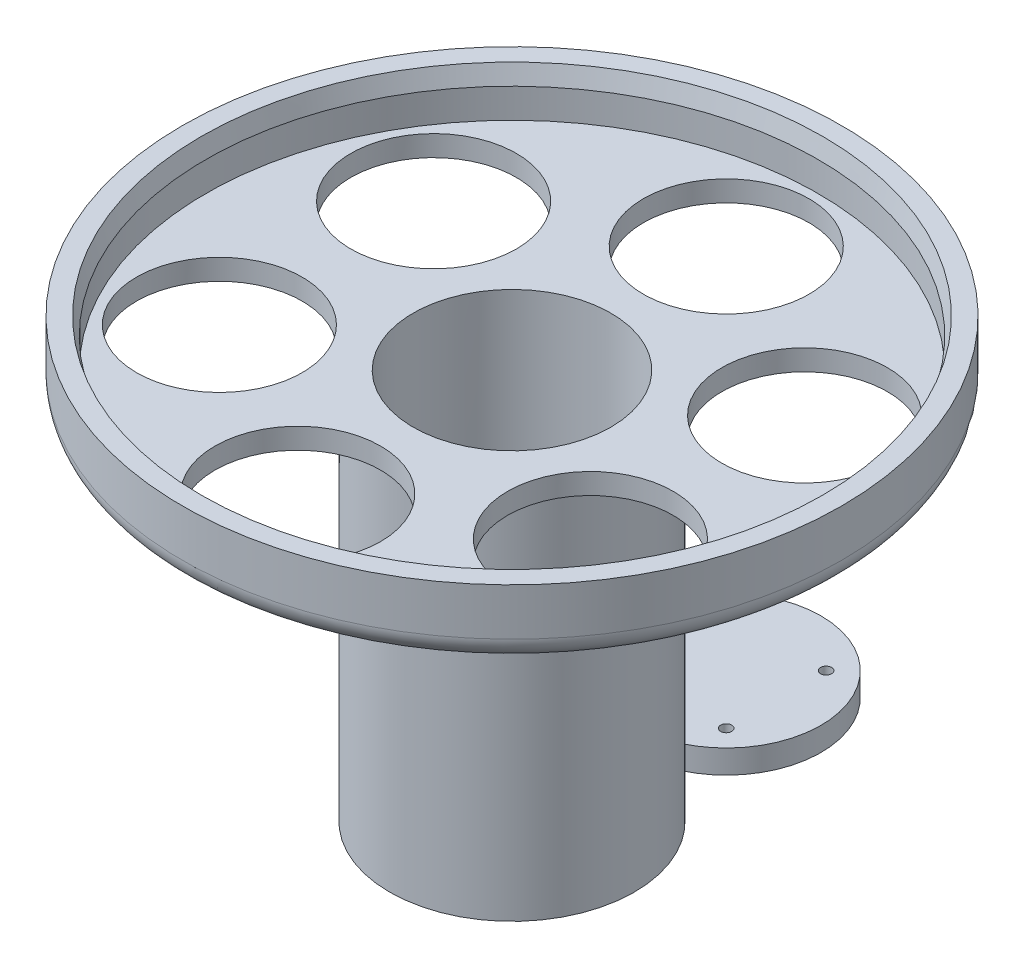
ISO-10303-21;
HEADER;
FILE_DESCRIPTION(('STEP AP214'),'2;1');
FILE_NAME('part.step','',(''),(''),'','','');
FILE_SCHEMA(('AUTOMOTIVE_DESIGN { 1 0 10303 214 1 1 1 1 }'));
ENDSEC;
DATA;
#1=APPLICATION_CONTEXT('core data for automotive mechanical design processes');
#2=APPLICATION_PROTOCOL_DEFINITION('international standard','automotive_design',2000,#1);
#3=PRODUCT_CONTEXT('',#1,'mechanical');
#4=PRODUCT('Part','Part','',(#3));
#5=PRODUCT_RELATED_PRODUCT_CATEGORY('part','',(#4));
#6=PRODUCT_DEFINITION_FORMATION('','',#4);
#7=PRODUCT_DEFINITION_CONTEXT('part definition',#1,'design');
#8=PRODUCT_DEFINITION('design','',#6,#7);
#9=PRODUCT_DEFINITION_SHAPE('','',#8);
#10=(LENGTH_UNIT() NAMED_UNIT(*) SI_UNIT(.MILLI.,.METRE.));
#11=(NAMED_UNIT(*) PLANE_ANGLE_UNIT() SI_UNIT($,.RADIAN.));
#12=(NAMED_UNIT(*) SI_UNIT($,.STERADIAN.) SOLID_ANGLE_UNIT());
#13=UNCERTAINTY_MEASURE_WITH_UNIT(LENGTH_MEASURE(1.E-05),#10,'distance_accuracy_value','');
#14=(GEOMETRIC_REPRESENTATION_CONTEXT(3) GLOBAL_UNCERTAINTY_ASSIGNED_CONTEXT((#13)) GLOBAL_UNIT_ASSIGNED_CONTEXT((#10,
#11,#12)) REPRESENTATION_CONTEXT('',''));
#15=CARTESIAN_POINT('',(0.,0.,0.));
#16=DIRECTION('',(0.,0.,1.));
#17=DIRECTION('',(1.,0.,0.));
#18=AXIS2_PLACEMENT_3D('',#15,#16,#17);
#19=CARTESIAN_POINT('',(-21.,-93.0200000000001,0.));
#20=DIRECTION('',(0.,1.,0.));
#21=DIRECTION('',(-1.,0.,0.));
#22=AXIS2_PLACEMENT_3D('',#19,#20,#21);
#23=PLANE('',#22);
#24=CARTESIAN_POINT('',(10.6066017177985,-93.0199999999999,-56.1066017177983));
#25=DIRECTION('',(0.,-1.,0.));
#26=DIRECTION('',(0.,0.,-1.));
#27=AXIS2_PLACEMENT_3D('',#24,#25,#26);
#28=CIRCLE('',#27,1.175);
#29=CARTESIAN_POINT('',(10.6066017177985,-93.0199999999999,-57.2816017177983));
#30=VERTEX_POINT('',#29);
#31=EDGE_CURVE('E594',#30,#30,#28,.T.);
#32=ORIENTED_EDGE('',*,*,#31,.F.);
#33=EDGE_LOOP('',(#32));
#34=FACE_BOUND('',#33,.T.);
#35=CARTESIAN_POINT('',(-10.6066017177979,-93.02,-34.8933982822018));
#36=DIRECTION('',(0.,-1.,0.));
#37=DIRECTION('',(0.,0.,-1.));
#38=AXIS2_PLACEMENT_3D('',#35,#36,#37);
#39=CIRCLE('',#38,1.175);
#40=CARTESIAN_POINT('',(-10.6066017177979,-93.02,-36.0683982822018));
#41=VERTEX_POINT('',#40);
#42=EDGE_CURVE('E608',#41,#41,#39,.T.);
#43=ORIENTED_EDGE('',*,*,#42,.F.);
#44=EDGE_LOOP('',(#43));
#45=FACE_BOUND('',#44,.T.);
#46=CARTESIAN_POINT('',(3.18893482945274E-13,-93.02,0.));
#47=DIRECTION('',(0.,1.,0.));
#48=DIRECTION('',(-1.,0.,0.));
#49=AXIS2_PLACEMENT_3D('',#46,#47,#48);
#50=CIRCLE('',#49,23.5000000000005);
#51=CARTESIAN_POINT('',(-23.5000000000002,-93.0200000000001,0.));
#52=VERTEX_POINT('',#51);
#53=EDGE_CURVE('E11',#52,#52,#50,.T.);
#54=ORIENTED_EDGE('',*,*,#53,.T.);
#55=EDGE_LOOP('',(#54));
#56=FACE_BOUND('',#55,.T.);
#57=CARTESIAN_POINT('',(3.18893482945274E-13,-93.02,0.));
#58=DIRECTION('',(0.,1.,0.));
#59=DIRECTION('',(-1.,0.,0.));
#60=AXIS2_PLACEMENT_3D('',#57,#58,#59);
#61=CIRCLE('',#60,26.0000000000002);
#62=CARTESIAN_POINT('',(3.79726114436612,-93.02,-25.7212131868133));
#63=VERTEX_POINT('',#62);
#64=CARTESIAN_POINT('',(-3.79726114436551,-93.02,-25.7212131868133));
#65=VERTEX_POINT('',#64);
#66=EDGE_CURVE('E164',#63,#65,#61,.F.);
#67=ORIENTED_EDGE('',*,*,#66,.T.);
#68=CARTESIAN_POINT('',(3.01290859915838E-13,-93.02,-45.5000000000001));
#69=DIRECTION('',(0.,-1.,0.));
#70=DIRECTION('',(1.,0.,0.));
#71=AXIS2_PLACEMENT_3D('',#68,#69,#70);
#72=CIRCLE('',#71,20.14);
#73=EDGE_CURVE('E70',#65,#63,#72,.T.);
#74=ORIENTED_EDGE('',*,*,#73,.T.);
#75=EDGE_LOOP('',(#67,#74));
#76=FACE_BOUND('',#75,.T.);
#77=CARTESIAN_POINT('',(10.6066017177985,-93.0199999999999,-34.8933982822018));
#78=DIRECTION('',(0.,-1.,0.));
#79=DIRECTION('',(0.,0.,-1.));
#80=AXIS2_PLACEMENT_3D('',#77,#78,#79);
#81=CIRCLE('',#80,1.175);
#82=CARTESIAN_POINT('',(10.6066017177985,-93.0199999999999,-36.0683982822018));
#83=VERTEX_POINT('',#82);
#84=EDGE_CURVE('E616',#83,#83,#81,.T.);
#85=ORIENTED_EDGE('',*,*,#84,.F.);
#86=EDGE_LOOP('',(#85));
#87=FACE_BOUND('',#86,.T.);
#88=CARTESIAN_POINT('',(-10.6066017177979,-93.02,-56.1066017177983));
#89=DIRECTION('',(0.,-1.,0.));
#90=DIRECTION('',(0.,0.,-1.));
#91=AXIS2_PLACEMENT_3D('',#88,#89,#90);
#92=CIRCLE('',#91,1.175);
#93=CARTESIAN_POINT('',(-10.6066017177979,-93.02,-57.2816017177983));
#94=VERTEX_POINT('',#93);
#95=EDGE_CURVE('E598',#94,#94,#92,.T.);
#96=ORIENTED_EDGE('',*,*,#95,.F.);
#97=EDGE_LOOP('',(#96));
#98=FACE_BOUND('',#97,.T.);
#99=ADVANCED_FACE('F47',(#34,#45,#56,#76,#87,#98),#23,.F.);
#100=CARTESIAN_POINT('',(0.,0.,0.));
#101=DIRECTION('',(0.,-1.,0.));
#102=DIRECTION('',(1.,0.,0.));
#103=AXIS2_PLACEMENT_3D('',#100,#101,#102);
#104=CYLINDRICAL_SURFACE('',#103,26.0000000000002);
#105=DIRECTION('',(0.,-1.,0.));
#106=VECTOR('',#105,1.);
#107=CARTESIAN_POINT('',(3.79726114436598,-51.5099999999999,-25.7212131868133));
#108=LINE('',#107,#106);
#109=CARTESIAN_POINT('',(3.79726114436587,-15.4999999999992,-25.7212131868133));
#110=VERTEX_POINT('',#109);
#111=CARTESIAN_POINT('',(3.79726114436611,-88.0199999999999,-25.7212131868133));
#112=VERTEX_POINT('',#111);
#113=EDGE_CURVE('E95',#110,#112,#108,.T.);
#114=ORIENTED_EDGE('',*,*,#113,.F.);
#115=CARTESIAN_POINT('',(0.,-15.4999999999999,0.));
#116=DIRECTION('',(0.,1.,0.));
#117=DIRECTION('',(-1.,0.,0.));
#118=AXIS2_PLACEMENT_3D('',#115,#116,#117);
#119=CIRCLE('',#118,26.0000000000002);
#120=CARTESIAN_POINT('',(-3.79726114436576,-15.4999999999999,-25.7212131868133));
#121=VERTEX_POINT('',#120);
#122=EDGE_CURVE('E110',#110,#121,#119,.F.);
#123=ORIENTED_EDGE('',*,*,#122,.T.);
#124=DIRECTION('',(0.,-1.,0.));
#125=VECTOR('',#124,1.);
#126=CARTESIAN_POINT('',(-3.79726114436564,-51.5099999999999,-25.7212131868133));
#127=LINE('',#126,#125);
#128=CARTESIAN_POINT('',(-3.79726114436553,-88.02,-25.7212131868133));
#129=VERTEX_POINT('',#128);
#130=EDGE_CURVE('E92',#129,#121,#127,.F.);
#131=ORIENTED_EDGE('',*,*,#130,.F.);
#132=DIRECTION('',(0.,-1.,0.));
#133=VECTOR('',#132,1.);
#134=CARTESIAN_POINT('',(-3.79726114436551,-90.52,-25.7212131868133));
#135=LINE('',#134,#133);
#136=EDGE_CURVE('E108',#129,#65,#135,.T.);
#137=ORIENTED_EDGE('',*,*,#136,.T.);
#138=ORIENTED_EDGE('',*,*,#66,.F.);
#139=DIRECTION('',(0.,-1.,0.));
#140=VECTOR('',#139,1.);
#141=CARTESIAN_POINT('',(3.79726114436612,-90.52,-25.7212131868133));
#142=LINE('',#141,#140);
#143=EDGE_CURVE('E120',#63,#112,#142,.F.);
#144=ORIENTED_EDGE('',*,*,#143,.T.);
#145=EDGE_LOOP('',(#114,#123,#131,#137,#138,#144));
#146=FACE_BOUND('',#145,.T.);
#147=ADVANCED_FACE('F106',(#146),#104,.T.);
#148=CARTESIAN_POINT('',(0.,-15.4999999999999,0.));
#149=DIRECTION('',(0.,1.,0.));
#150=DIRECTION('',(-1.,0.,0.));
#151=AXIS2_PLACEMENT_3D('',#148,#149,#150);
#152=TOROIDAL_SURFACE('',#151,26.5000000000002,0.5);
#153=CARTESIAN_POINT('',(6.09253702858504,-15.5001999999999,-26.3036307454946));
#154=CARTESIAN_POINT('',(6.09258310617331,-15.4848406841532,-26.3036458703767));
#155=CARTESIAN_POINT('',(6.09123858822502,-15.4695252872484,-26.3032186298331));
#156=CARTESIAN_POINT('',(6.08608211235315,-15.439512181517,-26.3015829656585));
#157=CARTESIAN_POINT('',(6.08229527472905,-15.424809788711,-26.3003824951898));
#158=CARTESIAN_POINT('',(6.07149385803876,-15.3931058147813,-26.2969638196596));
#159=CARTESIAN_POINT('',(6.06395504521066,-15.376303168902,-26.294580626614));
#160=CARTESIAN_POINT('',(6.04636214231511,-15.3441666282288,-26.2890346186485));
#161=CARTESIAN_POINT('',(6.03629787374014,-15.3288390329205,-26.2858686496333));
#162=CARTESIAN_POINT('',(6.00873065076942,-15.2923747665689,-26.2772256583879));
#163=CARTESIAN_POINT('',(5.99004180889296,-15.2722276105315,-26.2713902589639));
#164=CARTESIAN_POINT('',(5.94998303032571,-15.2351244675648,-26.2589566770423));
#165=CARTESIAN_POINT('',(5.92860746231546,-15.2181753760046,-26.2523568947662));
#166=CARTESIAN_POINT('',(5.86627459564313,-15.1744566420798,-26.2332368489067));
#167=CARTESIAN_POINT('',(5.82336547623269,-15.1507172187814,-26.2202145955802));
#168=CARTESIAN_POINT('',(5.73476396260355,-15.1097681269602,-26.1936733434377));
#169=CARTESIAN_POINT('',(5.68906593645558,-15.0925722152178,-26.1801533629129));
#170=CARTESIAN_POINT('',(5.59652268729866,-15.06341875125,-26.15314404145));
#171=CARTESIAN_POINT('',(5.5496909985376,-15.0514166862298,-26.1396554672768));
#172=CARTESIAN_POINT('',(5.45510987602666,-15.0315134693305,-26.1127928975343));
#173=CARTESIAN_POINT('',(5.40735959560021,-15.0236163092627,-26.0994190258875));
#174=CARTESIAN_POINT('',(5.31114516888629,-15.0112959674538,-26.0728582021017));
#175=CARTESIAN_POINT('',(5.26267882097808,-15.006888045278,-26.0596723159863));
#176=CARTESIAN_POINT('',(5.16547384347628,-15.0011841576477,-26.0336183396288));
#177=CARTESIAN_POINT('',(5.11673513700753,-14.9998891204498,-26.0207503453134));
#178=CARTESIAN_POINT('',(4.99257966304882,-15.0001907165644,-25.9884699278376));
#179=CARTESIAN_POINT('',(4.91709645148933,-15.0037473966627,-25.9693119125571));
#180=CARTESIAN_POINT('',(4.76647252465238,-15.0170833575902,-25.9320066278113));
#181=CARTESIAN_POINT('',(4.69133172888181,-15.0268610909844,-25.9138591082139));
#182=CARTESIAN_POINT('',(4.54229367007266,-15.0526330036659,-25.878761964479));
#183=CARTESIAN_POINT('',(4.46839164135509,-15.0685893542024,-25.8618057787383));
#184=CARTESIAN_POINT('',(4.35883905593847,-15.0978628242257,-25.8373062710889));
#185=CARTESIAN_POINT('',(4.32256668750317,-15.1084998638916,-25.8293015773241));
#186=CARTESIAN_POINT('',(4.25061392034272,-15.1318182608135,-25.8136282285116));
#187=CARTESIAN_POINT('',(4.2149333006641,-15.1444988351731,-25.8059594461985));
#188=CARTESIAN_POINT('',(4.15339007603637,-15.1687975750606,-25.7929029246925));
#189=CARTESIAN_POINT('',(4.12733094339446,-15.1798705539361,-25.7874296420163));
#190=CARTESIAN_POINT('',(4.07585659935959,-15.2037059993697,-25.776722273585));
#191=CARTESIAN_POINT('',(4.05044301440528,-15.2164723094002,-25.7714887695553));
#192=CARTESIAN_POINT('',(3.9978381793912,-15.2456917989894,-25.7607575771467));
#193=CARTESIAN_POINT('',(3.97077960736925,-15.2624003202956,-25.7552989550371));
#194=CARTESIAN_POINT('',(3.91907817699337,-15.2993827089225,-25.7449726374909));
#195=CARTESIAN_POINT('',(3.89442504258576,-15.3196402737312,-25.7401024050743));
#196=CARTESIAN_POINT('',(3.86325778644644,-15.351829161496,-25.7339956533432));
#197=CARTESIAN_POINT('',(3.85463273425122,-15.3616080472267,-25.7323123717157));
#198=CARTESIAN_POINT('',(3.83860698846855,-15.382179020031,-25.7291942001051));
#199=CARTESIAN_POINT('',(3.83120588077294,-15.3929707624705,-25.7277592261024));
#200=CARTESIAN_POINT('',(3.8191548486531,-15.4138824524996,-25.7254282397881));
#201=CARTESIAN_POINT('',(3.81425711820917,-15.4238518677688,-25.7244833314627));
#202=CARTESIAN_POINT('',(3.80614050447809,-15.4444650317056,-25.7229195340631));
#203=CARTESIAN_POINT('',(3.80291598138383,-15.4551063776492,-25.7222995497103));
#204=CARTESIAN_POINT('',(3.79957187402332,-15.4715777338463,-25.7216569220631));
#205=CARTESIAN_POINT('',(3.79870484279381,-15.4772556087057,-25.7214903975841));
#206=CARTESIAN_POINT('',(3.79754387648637,-15.4886874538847,-25.7212674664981));
#207=CARTESIAN_POINT('',(3.79725154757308,-15.4944415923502,-25.721211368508));
#208=CARTESIAN_POINT('',(3.79726126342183,-15.5001999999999,-25.7212132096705));
#209=B_SPLINE_CURVE_WITH_KNOTS('',3,(#153,#154,#155,#156,#157,#158,#159,#160,#161,#162,#163,
#164,#165,#166,#167,#168,#169,#170,#171,#172,#173,#174,#175,#176,#177,#178,#179,#180,#181,#182,
#183,#184,#185,#186,#187,#188,#189,#190,#191,#192,#193,#194,#195,#196,#197,#198,#199,#200,#201,
#202,#203,#204,#205,#206,#207,#208),.UNSPECIFIED.,.F.,.F.,(4,2,2,2,2,2,2,2,2,2,2,2,2,2,2,2,2,2,
2,2,2,2,2,2,2,2,2,4),(0.,0.0459392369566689,0.0914133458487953,0.146816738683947,
0.202447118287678,0.28625220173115,0.370235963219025,0.52159683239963,0.67327418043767,
0.823624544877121,0.974120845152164,1.12527173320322,1.27646768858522,1.5100453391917,
1.74356491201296,1.97567680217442,2.09154803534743,2.20737498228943,2.29384789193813,
2.38052054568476,2.47718214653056,2.57341084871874,2.61278278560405,2.65214137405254,
2.68546774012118,2.71868103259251,2.73589186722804,2.75315073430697),.UNSPECIFIED.);
#210=CARTESIAN_POINT('',(5.07413250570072,-14.9999999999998,-26.0096747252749));
#211=VERTEX_POINT('',#210);
#212=EDGE_CURVE('E112',#211,#110,#209,.T.);
#213=ORIENTED_EDGE('',*,*,#212,.F.);
#214=CARTESIAN_POINT('',(0.,-14.9999999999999,0.));
#215=DIRECTION('',(0.,1.,0.));
#216=DIRECTION('',(-1.,0.,0.));
#217=AXIS2_PLACEMENT_3D('',#214,#215,#216);
#218=CIRCLE('',#217,26.5000000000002);
#219=CARTESIAN_POINT('',(-5.07413250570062,-14.9999999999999,-26.0096747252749));
#220=VERTEX_POINT('',#219);
#221=EDGE_CURVE('E237',#220,#211,#218,.T.);
#222=ORIENTED_EDGE('',*,*,#221,.F.);
#223=CARTESIAN_POINT('',(-3.79726126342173,-15.5001999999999,-25.7212132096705));
#224=CARTESIAN_POINT('',(-3.79721352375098,-15.4894041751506,-25.7212042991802));
#225=CARTESIAN_POINT('',(-3.7982746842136,-15.4786580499,-25.7214077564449));
#226=CARTESIAN_POINT('',(-3.80228062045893,-15.4576905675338,-25.7221773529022));
#227=CARTESIAN_POINT('',(-3.80519781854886,-15.4474638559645,-25.7227381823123));
#228=CARTESIAN_POINT('',(-3.81357185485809,-15.4250220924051,-25.7243510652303));
#229=CARTESIAN_POINT('',(-3.81949498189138,-15.412991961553,-25.7254935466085));
#230=CARTESIAN_POINT('',(-3.83314623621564,-15.3899887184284,-25.7281351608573));
#231=CARTESIAN_POINT('',(-3.84088540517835,-15.3790226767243,-25.7296364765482));
#232=CARTESIAN_POINT('',(-3.86395175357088,-15.3501767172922,-25.7341279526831));
#233=CARTESIAN_POINT('',(-3.88057116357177,-15.3333867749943,-25.7373816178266));
#234=CARTESIAN_POINT('',(-3.91585468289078,-15.3022954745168,-25.7443423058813));
#235=CARTESIAN_POINT('',(-3.93452299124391,-15.2879993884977,-25.7480502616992));
#236=CARTESIAN_POINT('',(-3.98171414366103,-15.2553122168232,-25.7574986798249));
#237=CARTESIAN_POINT('',(-4.01090915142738,-15.2379506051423,-25.7634062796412));
#238=CARTESIAN_POINT('',(-4.07072257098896,-15.2060187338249,-25.7756557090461));
#239=CARTESIAN_POINT('',(-4.10134382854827,-15.1914543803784,-25.781998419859));
#240=CARTESIAN_POINT('',(-4.16362966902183,-15.1644341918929,-25.7950563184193));
#241=CARTESIAN_POINT('',(-4.19529914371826,-15.1519906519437,-25.8017733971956));
#242=CARTESIAN_POINT('',(-4.25919418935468,-15.1289320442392,-25.8154899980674));
#243=CARTESIAN_POINT('',(-4.29141926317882,-15.1183154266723,-25.8224892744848));
#244=CARTESIAN_POINT('',(-4.39268637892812,-15.0875855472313,-25.8447497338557));
#245=CARTESIAN_POINT('',(-4.46245849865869,-15.0701865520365,-25.8604672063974));
#246=CARTESIAN_POINT('',(-4.60301454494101,-15.0411779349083,-25.8929329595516));
#247=CARTESIAN_POINT('',(-4.67379965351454,-15.0295757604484,-25.9096825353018));
#248=CARTESIAN_POINT('',(-4.81551945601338,-15.0119411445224,-25.9440376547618));
#249=CARTESIAN_POINT('',(-4.88645208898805,-15.0058841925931,-25.9616390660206));
#250=CARTESIAN_POINT('',(-5.02830313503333,-14.9994551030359,-25.997663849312));
#251=CARTESIAN_POINT('',(-5.09922148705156,-14.9990770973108,-26.0160863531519));
#252=CARTESIAN_POINT('',(-5.22225136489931,-15.0039389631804,-26.0487629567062));
#253=CARTESIAN_POINT('',(-5.27446087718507,-15.0077444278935,-26.0628561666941));
#254=CARTESIAN_POINT('',(-5.37845897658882,-15.0193224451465,-26.0913757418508));
#255=CARTESIAN_POINT('',(-5.43024654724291,-15.0271027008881,-26.1058027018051));
#256=CARTESIAN_POINT('',(-5.5443683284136,-15.0495989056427,-26.1380834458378));
#257=CARTESIAN_POINT('',(-5.60648247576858,-15.0654736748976,-26.1559847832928));
#258=CARTESIAN_POINT('',(-5.69729408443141,-15.0961069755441,-26.1826130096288));
#259=CARTESIAN_POINT('',(-5.72712579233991,-15.1074315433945,-26.19143793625));
#260=CARTESIAN_POINT('',(-5.78566794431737,-15.1327717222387,-26.2088991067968));
#261=CARTESIAN_POINT('',(-5.81437966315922,-15.1467841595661,-26.2175355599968));
#262=CARTESIAN_POINT('',(-5.86297854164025,-15.1740407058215,-26.2322665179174));
#263=CARTESIAN_POINT('',(-5.88324266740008,-15.186562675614,-26.2384456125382));
#264=CARTESIAN_POINT('',(-5.92248048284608,-15.2137075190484,-26.2504741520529));
#265=CARTESIAN_POINT('',(-5.9414526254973,-15.2283328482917,-26.2563232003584));
#266=CARTESIAN_POINT('',(-5.97766734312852,-15.2601577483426,-26.2675416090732));
#267=CARTESIAN_POINT('',(-5.99489002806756,-15.2773823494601,-26.2729053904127));
#268=CARTESIAN_POINT('',(-6.0263804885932,-15.3145860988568,-26.2827523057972));
#269=CARTESIAN_POINT('',(-6.04065619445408,-15.3345576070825,-26.2872378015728));
#270=CARTESIAN_POINT('',(-6.06051410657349,-15.369618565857,-26.2934949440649));
#271=CARTESIAN_POINT('',(-6.06738067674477,-15.3839068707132,-26.2956638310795));
#272=CARTESIAN_POINT('',(-6.07883728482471,-15.4134393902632,-26.2992871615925));
#273=CARTESIAN_POINT('',(-6.0834334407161,-15.4286809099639,-26.3007435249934));
#274=CARTESIAN_POINT('',(-6.08862686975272,-15.4533957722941,-26.3023900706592));
#275=CARTESIAN_POINT('',(-6.09009098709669,-15.4626744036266,-26.3028545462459));
#276=CARTESIAN_POINT('',(-6.09205312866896,-15.4813661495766,-26.3034771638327));
#277=CARTESIAN_POINT('',(-6.09254874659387,-15.4907795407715,-26.3036345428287));
#278=CARTESIAN_POINT('',(-6.09253702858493,-15.5001999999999,-26.3036307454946));
#279=B_SPLINE_CURVE_WITH_KNOTS('',3,(#223,#224,#225,#226,#227,#228,#229,#230,#231,#232,#233,
#234,#235,#236,#237,#238,#239,#240,#241,#242,#243,#244,#245,#246,#247,#248,#249,#250,#251,#252,
#253,#254,#255,#256,#257,#258,#259,#260,#261,#262,#263,#264,#265,#266,#267,#268,#269,#270,#271,
#272,#273,#274,#275,#276,#277,#278),.UNSPECIFIED.,.F.,.F.,(4,2,2,2,2,2,2,2,2,2,2,2,2,2,2,2,2,2,
2,2,2,2,2,2,2,2,2,4),(0.,0.0322504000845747,0.0640324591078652,0.104177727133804,
0.144573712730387,0.215714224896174,0.287003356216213,0.39018704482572,0.493586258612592,
0.597565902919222,0.70145689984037,0.921945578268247,1.14271680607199,1.36250742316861,
1.5820709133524,1.74457576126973,1.90739674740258,2.10648291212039,2.20571100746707,
2.30482265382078,2.3785537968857,2.45237172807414,2.52695216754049,2.60132921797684,
2.64916404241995,2.69686925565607,2.7250326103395,2.7532658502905),.UNSPECIFIED.);
#280=EDGE_CURVE('E113',#121,#220,#279,.T.);
#281=ORIENTED_EDGE('',*,*,#280,.F.);
#282=ORIENTED_EDGE('',*,*,#122,.F.);
#283=EDGE_LOOP('',(#213,#222,#281,#282));
#284=FACE_BOUND('',#283,.T.);
#285=ADVANCED_FACE('F263',(#284),#152,.F.);
#286=CARTESIAN_POINT('',(0.,1.07498440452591E-13,0.));
#287=DIRECTION('',(0.,-1.,0.));
#288=DIRECTION('',(1.,0.,0.));
#289=AXIS2_PLACEMENT_3D('',#286,#287,#288);
#290=PLANE('',#289);
#291=CARTESIAN_POINT('',(0.,1.07498440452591E-13,0.));
#292=DIRECTION('',(0.,-1.,0.));
#293=DIRECTION('',(1.,0.,0.));
#294=AXIS2_PLACEMENT_3D('',#291,#292,#293);
#295=CIRCLE('',#294,66.0000000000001);
#296=CARTESIAN_POINT('',(66.0000000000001,3.33761285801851E-13,0.));
#297=VERTEX_POINT('',#296);
#298=EDGE_CURVE('E169',#297,#297,#295,.T.);
#299=ORIENTED_EDGE('',*,*,#298,.T.);
#300=EDGE_LOOP('',(#299));
#301=FACE_BOUND('',#300,.T.);
#302=CARTESIAN_POINT('',(0.,1.07498440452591E-13,0.));
#303=DIRECTION('',(0.,-1.,0.));
#304=DIRECTION('',(1.,0.,0.));
#305=AXIS2_PLACEMENT_3D('',#302,#303,#304);
#306=CIRCLE('',#305,70.);
#307=CARTESIAN_POINT('',(70.,3.47474185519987E-13,0.));
#308=VERTEX_POINT('',#307);
#309=EDGE_CURVE('E165',#308,#308,#306,.T.);
#310=ORIENTED_EDGE('',*,*,#309,.F.);
#311=EDGE_LOOP('',(#310));
#312=FACE_BOUND('',#311,.T.);
#313=ADVANCED_FACE('F271',(#301,#312),#290,.F.);
#314=CARTESIAN_POINT('',(0.,0.,0.));
#315=DIRECTION('',(0.,-1.,0.));
#316=DIRECTION('',(1.,0.,0.));
#317=AXIS2_PLACEMENT_3D('',#314,#315,#316);
#318=CYLINDRICAL_SURFACE('',#317,70.);
#319=CARTESIAN_POINT('',(0.,-9.99999999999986,0.));
#320=DIRECTION('',(0.,1.,0.));
#321=DIRECTION('',(-1.,0.,0.));
#322=AXIS2_PLACEMENT_3D('',#319,#320,#321);
#323=CIRCLE('',#322,70.);
#324=CARTESIAN_POINT('',(-70.,-10.0000000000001,0.));
#325=VERTEX_POINT('',#324);
#326=EDGE_CURVE('E231',#325,#325,#323,.T.);
#327=ORIENTED_EDGE('',*,*,#326,.T.);
#328=EDGE_LOOP('',(#327));
#329=FACE_BOUND('',#328,.T.);
#330=ORIENTED_EDGE('',*,*,#309,.T.);
#331=EDGE_LOOP('',(#330));
#332=FACE_BOUND('',#331,.T.);
#333=ADVANCED_FACE('F274',(#329,#332),#318,.T.);
#334=CARTESIAN_POINT('',(-65.,-15.0000000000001,0.));
#335=DIRECTION('',(0.,1.,0.));
#336=DIRECTION('',(-1.,0.,0.));
#337=AXIS2_PLACEMENT_3D('',#334,#335,#336);
#338=PLANE('',#337);
#339=ORIENTED_EDGE('',*,*,#221,.T.);
#340=CARTESIAN_POINT('',(0.,-14.9999999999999,-45.5000000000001));
#341=DIRECTION('',(0.,1.,0.));
#342=DIRECTION('',(-1.,0.,0.));
#343=AXIS2_PLACEMENT_3D('',#340,#341,#342);
#344=CIRCLE('',#343,20.14);
#345=EDGE_CURVE('E63',#220,#211,#344,.T.);
#346=ORIENTED_EDGE('',*,*,#345,.F.);
#347=EDGE_LOOP('',(#339,#346));
#348=FACE_BOUND('',#347,.T.);
#349=CARTESIAN_POINT('',(0.,-14.9999999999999,0.));
#350=DIRECTION('',(0.,1.,0.));
#351=DIRECTION('',(-1.,0.,0.));
#352=AXIS2_PLACEMENT_3D('',#349,#350,#351);
#353=CIRCLE('',#352,65.);
#354=CARTESIAN_POINT('',(-65.,-15.0000000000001,0.));
#355=VERTEX_POINT('',#354);
#356=EDGE_CURVE('E227',#355,#355,#353,.F.);
#357=ORIENTED_EDGE('',*,*,#356,.T.);
#358=EDGE_LOOP('',(#357));
#359=FACE_BOUND('',#358,.T.);
#360=CARTESIAN_POINT('',(0.,-14.9999999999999,45.5000000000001));
#361=DIRECTION('',(0.,1.,0.));
#362=DIRECTION('',(-1.,0.,0.));
#363=AXIS2_PLACEMENT_3D('',#360,#361,#362);
#364=CIRCLE('',#363,18.59);
#365=CARTESIAN_POINT('',(-18.59,-14.9999999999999,45.5000000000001));
#366=VERTEX_POINT('',#365);
#367=EDGE_CURVE('E203',#366,#366,#364,.T.);
#368=ORIENTED_EDGE('',*,*,#367,.T.);
#369=EDGE_LOOP('',(#368));
#370=FACE_BOUND('',#369,.T.);
#371=CARTESIAN_POINT('',(39.404155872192,-14.9999999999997,22.7500000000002));
#372=DIRECTION('',(0.,1.,0.));
#373=DIRECTION('',(-1.,0.,0.));
#374=AXIS2_PLACEMENT_3D('',#371,#372,#373);
#375=CIRCLE('',#374,18.5900000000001);
#376=CARTESIAN_POINT('',(20.8141558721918,-14.9999999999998,22.7500000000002));
#377=VERTEX_POINT('',#376);
#378=EDGE_CURVE('E199',#377,#377,#375,.T.);
#379=ORIENTED_EDGE('',*,*,#378,.T.);
#380=EDGE_LOOP('',(#379));
#381=FACE_BOUND('',#380,.T.);
#382=CARTESIAN_POINT('',(39.4041558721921,-14.9999999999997,-22.7499999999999));
#383=DIRECTION('',(0.,1.,0.));
#384=DIRECTION('',(-1.,0.,0.));
#385=AXIS2_PLACEMENT_3D('',#382,#383,#384);
#386=CIRCLE('',#385,18.5900000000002);
#387=CARTESIAN_POINT('',(20.8141558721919,-14.9999999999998,-22.7499999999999));
#388=VERTEX_POINT('',#387);
#389=EDGE_CURVE('E195',#388,#388,#386,.T.);
#390=ORIENTED_EDGE('',*,*,#389,.T.);
#391=EDGE_LOOP('',(#390));
#392=FACE_BOUND('',#391,.T.);
#393=CARTESIAN_POINT('',(-39.4041558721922,-15.,22.7499999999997));
#394=DIRECTION('',(0.,1.,0.));
#395=DIRECTION('',(-1.,0.,0.));
#396=AXIS2_PLACEMENT_3D('',#393,#394,#395);
#397=CIRCLE('',#396,18.5900000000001);
#398=CARTESIAN_POINT('',(-57.9941558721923,-15.0000000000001,22.7499999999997));
#399=VERTEX_POINT('',#398);
#400=EDGE_CURVE('E191',#399,#399,#397,.T.);
#401=ORIENTED_EDGE('',*,*,#400,.T.);
#402=EDGE_LOOP('',(#401));
#403=FACE_BOUND('',#402,.T.);
#404=CARTESIAN_POINT('',(-39.4041558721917,-15.,-22.7500000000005));
#405=DIRECTION('',(0.,1.,0.));
#406=DIRECTION('',(-1.,0.,0.));
#407=AXIS2_PLACEMENT_3D('',#404,#405,#406);
#408=CIRCLE('',#407,18.5900000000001);
#409=CARTESIAN_POINT('',(-57.9941558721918,-15.0000000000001,-22.7500000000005));
#410=VERTEX_POINT('',#409);
#411=EDGE_CURVE('E187',#410,#410,#408,.T.);
#412=ORIENTED_EDGE('',*,*,#411,.T.);
#413=EDGE_LOOP('',(#412));
#414=FACE_BOUND('',#413,.T.);
#415=CARTESIAN_POINT('',(0.,-14.9999999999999,-45.5000000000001));
#416=DIRECTION('',(0.,1.,0.));
#417=DIRECTION('',(-1.,0.,0.));
#418=AXIS2_PLACEMENT_3D('',#415,#416,#417);
#419=CIRCLE('',#418,18.59);
#420=CARTESIAN_POINT('',(-18.59,-14.9999999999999,-45.5000000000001));
#421=VERTEX_POINT('',#420);
#422=EDGE_CURVE('E183',#421,#421,#419,.T.);
#423=ORIENTED_EDGE('',*,*,#422,.T.);
#424=EDGE_LOOP('',(#423));
#425=FACE_BOUND('',#424,.T.);
#426=ADVANCED_FACE('F278',(#348,#359,#370,#381,#392,#403,#414,#425),#338,.F.);
#427=CARTESIAN_POINT('',(0.,0.,0.));
#428=DIRECTION('',(0.,-1.,0.));
#429=DIRECTION('',(1.,0.,0.));
#430=AXIS2_PLACEMENT_3D('',#427,#428,#429);
#431=CYLINDRICAL_SURFACE('',#430,65.);
#432=CARTESIAN_POINT('',(0.,-3.73205080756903,0.));
#433=DIRECTION('',(0.,-1.,0.));
#434=DIRECTION('',(1.,0.,0.));
#435=AXIS2_PLACEMENT_3D('',#432,#433,#434);
#436=CIRCLE('',#435,65.);
#437=CARTESIAN_POINT('',(65.,-3.73205080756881,0.));
#438=VERTEX_POINT('',#437);
#439=EDGE_CURVE('E175',#438,#438,#436,.F.);
#440=ORIENTED_EDGE('',*,*,#439,.T.);
#441=EDGE_LOOP('',(#440));
#442=FACE_BOUND('',#441,.T.);
#443=CARTESIAN_POINT('',(0.,-9.99999999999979,0.));
#444=DIRECTION('',(0.,-1.,0.));
#445=DIRECTION('',(1.,0.,0.));
#446=AXIS2_PLACEMENT_3D('',#443,#444,#445);
#447=CIRCLE('',#446,65.);
#448=CARTESIAN_POINT('',(65.0000000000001,-9.99999999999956,0.));
#449=VERTEX_POINT('',#448);
#450=EDGE_CURVE('E160',#449,#449,#447,.T.);
#451=ORIENTED_EDGE('',*,*,#450,.T.);
#452=EDGE_LOOP('',(#451));
#453=FACE_BOUND('',#452,.T.);
#454=ADVANCED_FACE('F269',(#442,#453),#431,.F.);
#455=CARTESIAN_POINT('',(-65.,-10.0000000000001,0.));
#456=DIRECTION('',(0.,1.,0.));
#457=DIRECTION('',(-1.,0.,0.));
#458=AXIS2_PLACEMENT_3D('',#455,#456,#457);
#459=PLANE('',#458);
#460=CARTESIAN_POINT('',(-39.4041558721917,-9.99999999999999,-22.7500000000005));
#461=DIRECTION('',(0.,1.,0.));
#462=DIRECTION('',(-0.50000000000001,0.,0.866025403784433));
#463=AXIS2_PLACEMENT_3D('',#460,#461,#462);
#464=CIRCLE('',#463,17.59);
#465=CARTESIAN_POINT('',(-48.1991558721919,-10.,-7.51661314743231));
#466=VERTEX_POINT('',#465);
#467=EDGE_CURVE('E132',#466,#466,#464,.T.);
#468=ORIENTED_EDGE('',*,*,#467,.F.);
#469=EDGE_LOOP('',(#468));
#470=FACE_BOUND('',#469,.T.);
#471=CARTESIAN_POINT('',(-39.4041558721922,-9.99999999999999,22.7499999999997));
#472=DIRECTION('',(0.,1.,0.));
#473=DIRECTION('',(0.499999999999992,0.,0.866025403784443));
#474=AXIS2_PLACEMENT_3D('',#471,#472,#473);
#475=CIRCLE('',#474,17.59);
#476=CARTESIAN_POINT('',(-30.6091558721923,-9.99999999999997,37.983386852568));
#477=VERTEX_POINT('',#476);
#478=EDGE_CURVE('E142',#477,#477,#475,.T.);
#479=ORIENTED_EDGE('',*,*,#478,.F.);
#480=EDGE_LOOP('',(#479));
#481=FACE_BOUND('',#480,.T.);
#482=CARTESIAN_POINT('',(0.,-9.99999999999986,45.5000000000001));
#483=DIRECTION('',(0.,1.,0.));
#484=DIRECTION('',(1.,0.,0.));
#485=AXIS2_PLACEMENT_3D('',#482,#483,#484);
#486=CIRCLE('',#485,17.59);
#487=CARTESIAN_POINT('',(17.59,-9.9999999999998,45.5000000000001));
#488=VERTEX_POINT('',#487);
#489=EDGE_CURVE('E138',#488,#488,#486,.T.);
#490=ORIENTED_EDGE('',*,*,#489,.F.);
#491=EDGE_LOOP('',(#490));
#492=FACE_BOUND('',#491,.T.);
#493=CARTESIAN_POINT('',(39.404155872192,-9.99999999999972,22.7500000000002));
#494=DIRECTION('',(0.,1.,0.));
#495=DIRECTION('',(0.500000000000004,0.,-0.866025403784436));
#496=AXIS2_PLACEMENT_3D('',#493,#494,#495);
#497=CIRCLE('',#496,17.59);
#498=CARTESIAN_POINT('',(48.199155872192,-9.99999999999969,7.51661314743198));
#499=VERTEX_POINT('',#498);
#500=EDGE_CURVE('E133',#499,#499,#497,.T.);
#501=ORIENTED_EDGE('',*,*,#500,.F.);
#502=EDGE_LOOP('',(#501));
#503=FACE_BOUND('',#502,.T.);
#504=CARTESIAN_POINT('',(39.4041558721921,-9.99999999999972,-22.7499999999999));
#505=DIRECTION('',(0.,1.,0.));
#506=DIRECTION('',(-0.499999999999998,0.,-0.86602540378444));
#507=AXIS2_PLACEMENT_3D('',#504,#505,#506);
#508=CIRCLE('',#507,17.59);
#509=CARTESIAN_POINT('',(30.6091558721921,-9.99999999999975,-37.9833868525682));
#510=VERTEX_POINT('',#509);
#511=EDGE_CURVE('E137',#510,#510,#508,.T.);
#512=ORIENTED_EDGE('',*,*,#511,.F.);
#513=EDGE_LOOP('',(#512));
#514=FACE_BOUND('',#513,.T.);
#515=CARTESIAN_POINT('',(0.,-9.99999999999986,-45.5000000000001));
#516=DIRECTION('',(0.,1.,0.));
#517=DIRECTION('',(-1.,0.,0.));
#518=AXIS2_PLACEMENT_3D('',#515,#516,#517);
#519=CIRCLE('',#518,17.59);
#520=CARTESIAN_POINT('',(-17.59,-9.99999999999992,-45.5000000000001));
#521=VERTEX_POINT('',#520);
#522=EDGE_CURVE('E152',#521,#521,#519,.T.);
#523=ORIENTED_EDGE('',*,*,#522,.F.);
#524=EDGE_LOOP('',(#523));
#525=FACE_BOUND('',#524,.T.);
#526=CARTESIAN_POINT('',(0.,-9.99999999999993,0.));
#527=DIRECTION('',(0.,-1.,0.));
#528=DIRECTION('',(1.,0.,0.));
#529=AXIS2_PLACEMENT_3D('',#526,#527,#528);
#530=CIRCLE('',#529,21.);
#531=CARTESIAN_POINT('',(21.0000000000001,-9.99999999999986,0.));
#532=VERTEX_POINT('',#531);
#533=EDGE_CURVE('E156',#532,#532,#530,.T.);
#534=ORIENTED_EDGE('',*,*,#533,.T.);
#535=EDGE_LOOP('',(#534));
#536=FACE_BOUND('',#535,.T.);
#537=ORIENTED_EDGE('',*,*,#450,.F.);
#538=EDGE_LOOP('',(#537));
#539=FACE_BOUND('',#538,.T.);
#540=ADVANCED_FACE('F381',(#470,#481,#492,#503,#514,#525,#536,#539),#459,.T.);
#541=CARTESIAN_POINT('',(0.,0.,0.));
#542=DIRECTION('',(0.,-1.,0.));
#543=DIRECTION('',(1.,0.,0.));
#544=AXIS2_PLACEMENT_3D('',#541,#542,#543);
#545=CYLINDRICAL_SURFACE('',#544,21.0000000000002);
#546=CARTESIAN_POINT('',(2.8690770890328E-13,-83.6898729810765,0.));
#547=DIRECTION('',(0.,1.,0.));
#548=DIRECTION('',(-1.,0.,0.));
#549=AXIS2_PLACEMENT_3D('',#546,#547,#548);
#550=CIRCLE('',#549,21.0000000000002);
#551=CARTESIAN_POINT('',(-20.9999999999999,-83.6898729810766,0.));
#552=VERTEX_POINT('',#551);
#553=EDGE_CURVE('E57',#552,#552,#550,.F.);
#554=ORIENTED_EDGE('',*,*,#553,.T.);
#555=EDGE_LOOP('',(#554));
#556=FACE_BOUND('',#555,.T.);
#557=ORIENTED_EDGE('',*,*,#533,.F.);
#558=EDGE_LOOP('',(#557));
#559=FACE_BOUND('',#558,.T.);
#560=ADVANCED_FACE('F243',(#556,#559),#545,.F.);
#561=CARTESIAN_POINT('',(0.,1.07498440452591E-13,0.));
#562=DIRECTION('',(0.,1.,0.));
#563=DIRECTION('',(-1.,0.,0.));
#564=AXIS2_PLACEMENT_3D('',#561,#562,#563);
#565=CONICAL_SURFACE('',#564,66.0000000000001,0.261799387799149);
#566=ORIENTED_EDGE('',*,*,#439,.F.);
#567=EDGE_LOOP('',(#566));
#568=FACE_BOUND('',#567,.T.);
#569=ORIENTED_EDGE('',*,*,#298,.F.);
#570=EDGE_LOOP('',(#569));
#571=FACE_BOUND('',#570,.T.);
#572=ADVANCED_FACE('F283',(#568,#571),#565,.F.);
#573=CARTESIAN_POINT('',(2.21984534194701E-13,-64.7520331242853,-45.5000000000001));
#574=DIRECTION('',(0.,1.,0.));
#575=DIRECTION('',(-1.,0.,0.));
#576=AXIS2_PLACEMENT_3D('',#573,#574,#575);
#577=CYLINDRICAL_SURFACE('',#576,17.59);
#578=CARTESIAN_POINT('',(0.,-14.4226497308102,-45.5000000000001));
#579=DIRECTION('',(0.,1.,0.));
#580=DIRECTION('',(-1.,0.,0.));
#581=AXIS2_PLACEMENT_3D('',#578,#579,#580);
#582=CIRCLE('',#581,17.59);
#583=CARTESIAN_POINT('',(-17.59,-14.4226497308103,-45.5000000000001));
#584=VERTEX_POINT('',#583);
#585=EDGE_CURVE('E223',#584,#584,#582,.F.);
#586=ORIENTED_EDGE('',*,*,#585,.T.);
#587=EDGE_LOOP('',(#586));
#588=FACE_BOUND('',#587,.T.);
#589=ORIENTED_EDGE('',*,*,#522,.T.);
#590=EDGE_LOOP('',(#589));
#591=FACE_BOUND('',#590,.T.);
#592=ADVANCED_FACE('F289',(#588,#591),#577,.F.);
#593=CARTESIAN_POINT('',(39.4041558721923,-64.7520331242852,-22.7499999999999));
#594=DIRECTION('',(0.,1.,0.));
#595=DIRECTION('',(-1.,0.,0.));
#596=AXIS2_PLACEMENT_3D('',#593,#594,#595);
#597=CYLINDRICAL_SURFACE('',#596,17.59);
#598=CARTESIAN_POINT('',(39.4041558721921,-14.4226497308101,-22.7499999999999));
#599=DIRECTION('',(0.,1.,0.));
#600=DIRECTION('',(0.,0.,1.));
#601=AXIS2_PLACEMENT_3D('',#598,#599,#600);
#602=CIRCLE('',#601,17.59);
#603=CARTESIAN_POINT('',(39.4041558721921,-14.4226497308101,-5.15999999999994));
#604=VERTEX_POINT('',#603);
#605=EDGE_CURVE('E211',#604,#604,#602,.F.);
#606=ORIENTED_EDGE('',*,*,#605,.T.);
#607=EDGE_LOOP('',(#606));
#608=FACE_BOUND('',#607,.T.);
#609=ORIENTED_EDGE('',*,*,#511,.T.);
#610=EDGE_LOOP('',(#609));
#611=FACE_BOUND('',#610,.T.);
#612=ADVANCED_FACE('F362',(#608,#611),#597,.F.);
#613=CARTESIAN_POINT('',(39.4041558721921,-64.7520331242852,22.7500000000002));
#614=DIRECTION('',(0.,1.,0.));
#615=DIRECTION('',(-1.,0.,0.));
#616=AXIS2_PLACEMENT_3D('',#613,#614,#615);
#617=CYLINDRICAL_SURFACE('',#616,17.59);
#618=CARTESIAN_POINT('',(39.404155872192,-14.4226497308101,22.7500000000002));
#619=DIRECTION('',(0.,1.,0.));
#620=DIRECTION('',(0.,0.,1.));
#621=AXIS2_PLACEMENT_3D('',#618,#619,#620);
#622=CIRCLE('',#621,17.59);
#623=CARTESIAN_POINT('',(39.404155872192,-14.4226497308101,40.3400000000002));
#624=VERTEX_POINT('',#623);
#625=EDGE_CURVE('E207',#624,#624,#622,.F.);
#626=ORIENTED_EDGE('',*,*,#625,.T.);
#627=EDGE_LOOP('',(#626));
#628=FACE_BOUND('',#627,.T.);
#629=ORIENTED_EDGE('',*,*,#500,.T.);
#630=EDGE_LOOP('',(#629));
#631=FACE_BOUND('',#630,.T.);
#632=ADVANCED_FACE('F358',(#628,#631),#617,.F.);
#633=CARTESIAN_POINT('',(2.21984534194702E-13,-64.7520331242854,45.5000000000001));
#634=DIRECTION('',(0.,1.,0.));
#635=DIRECTION('',(-1.,0.,0.));
#636=AXIS2_PLACEMENT_3D('',#633,#634,#635);
#637=CYLINDRICAL_SURFACE('',#636,17.59);
#638=CARTESIAN_POINT('',(0.,-14.4226497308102,45.5000000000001));
#639=DIRECTION('',(0.,1.,0.));
#640=DIRECTION('',(-1.,0.,0.));
#641=AXIS2_PLACEMENT_3D('',#638,#639,#640);
#642=CIRCLE('',#641,17.59);
#643=CARTESIAN_POINT('',(-17.59,-14.4226497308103,45.5000000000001));
#644=VERTEX_POINT('',#643);
#645=EDGE_CURVE('E179',#644,#644,#642,.F.);
#646=ORIENTED_EDGE('',*,*,#645,.T.);
#647=EDGE_LOOP('',(#646));
#648=FACE_BOUND('',#647,.T.);
#649=ORIENTED_EDGE('',*,*,#489,.T.);
#650=EDGE_LOOP('',(#649));
#651=FACE_BOUND('',#650,.T.);
#652=ADVANCED_FACE('F361',(#648,#651),#637,.F.);
#653=CARTESIAN_POINT('',(-39.404155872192,-64.7520331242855,22.7499999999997));
#654=DIRECTION('',(0.,1.,0.));
#655=DIRECTION('',(-1.,0.,0.));
#656=AXIS2_PLACEMENT_3D('',#653,#654,#655);
#657=CYLINDRICAL_SURFACE('',#656,17.59);
#658=CARTESIAN_POINT('',(-39.4041558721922,-14.4226497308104,22.7499999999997));
#659=DIRECTION('',(0.,1.,0.));
#660=DIRECTION('',(0.,0.,1.));
#661=AXIS2_PLACEMENT_3D('',#658,#659,#660);
#662=CIRCLE('',#661,17.59);
#663=CARTESIAN_POINT('',(-39.4041558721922,-14.4226497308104,40.3399999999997));
#664=VERTEX_POINT('',#663);
#665=EDGE_CURVE('E215',#664,#664,#662,.F.);
#666=ORIENTED_EDGE('',*,*,#665,.T.);
#667=EDGE_LOOP('',(#666));
#668=FACE_BOUND('',#667,.T.);
#669=ORIENTED_EDGE('',*,*,#478,.T.);
#670=EDGE_LOOP('',(#669));
#671=FACE_BOUND('',#670,.T.);
#672=ADVANCED_FACE('F366',(#668,#671),#657,.F.);
#673=CARTESIAN_POINT('',(-39.4041558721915,-64.7520331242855,-22.7500000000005));
#674=DIRECTION('',(0.,1.,0.));
#675=DIRECTION('',(-1.,0.,0.));
#676=AXIS2_PLACEMENT_3D('',#673,#674,#675);
#677=CYLINDRICAL_SURFACE('',#676,17.59);
#678=CARTESIAN_POINT('',(-39.4041558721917,-14.4226497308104,-22.7500000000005));
#679=DIRECTION('',(0.,1.,0.));
#680=DIRECTION('',(0.,0.,1.));
#681=AXIS2_PLACEMENT_3D('',#678,#679,#680);
#682=CIRCLE('',#681,17.59);
#683=CARTESIAN_POINT('',(-39.4041558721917,-14.4226497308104,-5.16000000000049));
#684=VERTEX_POINT('',#683);
#685=EDGE_CURVE('E219',#684,#684,#682,.F.);
#686=ORIENTED_EDGE('',*,*,#685,.T.);
#687=EDGE_LOOP('',(#686));
#688=FACE_BOUND('',#687,.T.);
#689=ORIENTED_EDGE('',*,*,#467,.T.);
#690=EDGE_LOOP('',(#689));
#691=FACE_BOUND('',#690,.T.);
#692=ADVANCED_FACE('F298',(#688,#691),#677,.F.);
#693=CARTESIAN_POINT('',(0.,-14.4226497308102,45.5000000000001));
#694=DIRECTION('',(0.,-1.,0.));
#695=DIRECTION('',(1.,0.,0.));
#696=AXIS2_PLACEMENT_3D('',#693,#694,#695);
#697=CONICAL_SURFACE('',#696,17.59,1.0471975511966);
#698=ORIENTED_EDGE('',*,*,#367,.F.);
#699=EDGE_LOOP('',(#698));
#700=FACE_BOUND('',#699,.T.);
#701=ORIENTED_EDGE('',*,*,#645,.F.);
#702=EDGE_LOOP('',(#701));
#703=FACE_BOUND('',#702,.T.);
#704=ADVANCED_FACE('F291',(#700,#703),#697,.F.);
#705=CARTESIAN_POINT('',(39.404155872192,-14.4226497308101,22.7500000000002));
#706=DIRECTION('',(0.,-1.,0.));
#707=DIRECTION('',(0.,0.,-1.));
#708=AXIS2_PLACEMENT_3D('',#705,#706,#707);
#709=CONICAL_SURFACE('',#708,17.59,1.0471975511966);
#710=ORIENTED_EDGE('',*,*,#378,.F.);
#711=EDGE_LOOP('',(#710));
#712=FACE_BOUND('',#711,.T.);
#713=ORIENTED_EDGE('',*,*,#625,.F.);
#714=EDGE_LOOP('',(#713));
#715=FACE_BOUND('',#714,.T.);
#716=ADVANCED_FACE('F297',(#712,#715),#709,.F.);
#717=CARTESIAN_POINT('',(39.4041558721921,-14.4226497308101,-22.7499999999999));
#718=DIRECTION('',(0.,-1.,0.));
#719=DIRECTION('',(0.,0.,-1.));
#720=AXIS2_PLACEMENT_3D('',#717,#718,#719);
#721=CONICAL_SURFACE('',#720,17.59,1.04719755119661);
#722=ORIENTED_EDGE('',*,*,#389,.F.);
#723=EDGE_LOOP('',(#722));
#724=FACE_BOUND('',#723,.T.);
#725=ORIENTED_EDGE('',*,*,#605,.F.);
#726=EDGE_LOOP('',(#725));
#727=FACE_BOUND('',#726,.T.);
#728=ADVANCED_FACE('F305',(#724,#727),#721,.F.);
#729=CARTESIAN_POINT('',(-39.4041558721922,-14.4226497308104,22.7499999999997));
#730=DIRECTION('',(0.,-1.,0.));
#731=DIRECTION('',(0.,0.,-1.));
#732=AXIS2_PLACEMENT_3D('',#729,#730,#731);
#733=CONICAL_SURFACE('',#732,17.59,1.0471975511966);
#734=ORIENTED_EDGE('',*,*,#400,.F.);
#735=EDGE_LOOP('',(#734));
#736=FACE_BOUND('',#735,.T.);
#737=ORIENTED_EDGE('',*,*,#665,.F.);
#738=EDGE_LOOP('',(#737));
#739=FACE_BOUND('',#738,.T.);
#740=ADVANCED_FACE('F312',(#736,#739),#733,.F.);
#741=CARTESIAN_POINT('',(-39.4041558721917,-14.4226497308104,-22.7500000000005));
#742=DIRECTION('',(0.,-1.,0.));
#743=DIRECTION('',(0.,0.,-1.));
#744=AXIS2_PLACEMENT_3D('',#741,#742,#743);
#745=CONICAL_SURFACE('',#744,17.59,1.0471975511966);
#746=ORIENTED_EDGE('',*,*,#411,.F.);
#747=EDGE_LOOP('',(#746));
#748=FACE_BOUND('',#747,.T.);
#749=ORIENTED_EDGE('',*,*,#685,.F.);
#750=EDGE_LOOP('',(#749));
#751=FACE_BOUND('',#750,.T.);
#752=ADVANCED_FACE('F319',(#748,#751),#745,.F.);
#753=CARTESIAN_POINT('',(0.,-14.4226497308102,-45.5000000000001));
#754=DIRECTION('',(0.,-1.,0.));
#755=DIRECTION('',(1.,0.,0.));
#756=AXIS2_PLACEMENT_3D('',#753,#754,#755);
#757=CONICAL_SURFACE('',#756,17.59,1.0471975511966);
#758=ORIENTED_EDGE('',*,*,#422,.F.);
#759=EDGE_LOOP('',(#758));
#760=FACE_BOUND('',#759,.T.);
#761=ORIENTED_EDGE('',*,*,#585,.F.);
#762=EDGE_LOOP('',(#761));
#763=FACE_BOUND('',#762,.T.);
#764=ADVANCED_FACE('F326',(#760,#763),#757,.F.);
#765=CARTESIAN_POINT('',(0.,-9.99999999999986,0.));
#766=DIRECTION('',(0.,1.,0.));
#767=DIRECTION('',(-1.,0.,0.));
#768=AXIS2_PLACEMENT_3D('',#765,#766,#767);
#769=TOROIDAL_SURFACE('',#768,65.,5.);
#770=ORIENTED_EDGE('',*,*,#326,.F.);
#771=EDGE_LOOP('',(#770));
#772=FACE_BOUND('',#771,.T.);
#773=ORIENTED_EDGE('',*,*,#356,.F.);
#774=EDGE_LOOP('',(#773));
#775=FACE_BOUND('',#774,.T.);
#776=ADVANCED_FACE('F332',(#772,#775),#769,.T.);
#777=CARTESIAN_POINT('',(2.85278027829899E-13,-88.02,-45.5000000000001));
#778=DIRECTION('',(0.,-1.,0.));
#779=DIRECTION('',(1.,0.,0.));
#780=AXIS2_PLACEMENT_3D('',#777,#778,#779);
#781=CYLINDRICAL_SURFACE('',#780,20.14);
#782=ORIENTED_EDGE('',*,*,#143,.F.);
#783=ORIENTED_EDGE('',*,*,#73,.F.);
#784=ORIENTED_EDGE('',*,*,#136,.F.);
#785=CARTESIAN_POINT('',(2.85278027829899E-13,-88.02,-45.5000000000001));
#786=DIRECTION('',(0.,-1.,0.));
#787=DIRECTION('',(1.,0.,0.));
#788=AXIS2_PLACEMENT_3D('',#785,#786,#787);
#789=CIRCLE('',#788,20.14);
#790=EDGE_CURVE('E117',#129,#112,#789,.T.);
#791=ORIENTED_EDGE('',*,*,#790,.T.);
#792=EDGE_LOOP('',(#782,#783,#784,#791));
#793=FACE_BOUND('',#792,.T.);
#794=ADVANCED_FACE('F116',(#793),#781,.T.);
#795=CARTESIAN_POINT('',(2.85278027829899E-13,-88.02,-45.5000000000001));
#796=DIRECTION('',(0.,-1.,0.));
#797=DIRECTION('',(1.,0.,0.));
#798=AXIS2_PLACEMENT_3D('',#795,#796,#797);
#799=PLANE('',#798);
#800=CARTESIAN_POINT('',(10.6066017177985,-88.0199999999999,-56.1066017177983));
#801=DIRECTION('',(0.,-1.,0.));
#802=DIRECTION('',(1.,0.,0.));
#803=AXIS2_PLACEMENT_3D('',#800,#801,#802);
#804=CIRCLE('',#803,1.175);
#805=CARTESIAN_POINT('',(11.7816017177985,-88.0199999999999,-56.1066017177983));
#806=VERTEX_POINT('',#805);
#807=EDGE_CURVE('E592',#806,#806,#804,.T.);
#808=ORIENTED_EDGE('',*,*,#807,.T.);
#809=EDGE_LOOP('',(#808));
#810=FACE_BOUND('',#809,.T.);
#811=CARTESIAN_POINT('',(-10.6066017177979,-88.02,-56.1066017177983));
#812=DIRECTION('',(0.,-1.,0.));
#813=DIRECTION('',(1.,0.,0.));
#814=AXIS2_PLACEMENT_3D('',#811,#812,#813);
#815=CIRCLE('',#814,1.175);
#816=CARTESIAN_POINT('',(-9.43160171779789,-88.02,-56.1066017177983));
#817=VERTEX_POINT('',#816);
#818=EDGE_CURVE('E604',#817,#817,#815,.T.);
#819=ORIENTED_EDGE('',*,*,#818,.T.);
#820=EDGE_LOOP('',(#819));
#821=FACE_BOUND('',#820,.T.);
#822=CARTESIAN_POINT('',(-10.6066017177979,-88.02,-34.8933982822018));
#823=DIRECTION('',(0.,-1.,0.));
#824=DIRECTION('',(1.,0.,0.));
#825=AXIS2_PLACEMENT_3D('',#822,#823,#824);
#826=CIRCLE('',#825,1.175);
#827=CARTESIAN_POINT('',(-9.43160171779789,-88.02,-34.8933982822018));
#828=VERTEX_POINT('',#827);
#829=EDGE_CURVE('E612',#828,#828,#826,.T.);
#830=ORIENTED_EDGE('',*,*,#829,.T.);
#831=EDGE_LOOP('',(#830));
#832=FACE_BOUND('',#831,.T.);
#833=CARTESIAN_POINT('',(10.6066017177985,-88.0199999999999,-34.8933982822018));
#834=DIRECTION('',(0.,-1.,0.));
#835=DIRECTION('',(1.,0.,0.));
#836=AXIS2_PLACEMENT_3D('',#833,#834,#835);
#837=CIRCLE('',#836,1.175);
#838=CARTESIAN_POINT('',(11.7816017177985,-88.0199999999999,-34.8933982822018));
#839=VERTEX_POINT('',#838);
#840=EDGE_CURVE('E100',#839,#839,#837,.T.);
#841=ORIENTED_EDGE('',*,*,#840,.T.);
#842=EDGE_LOOP('',(#841));
#843=FACE_BOUND('',#842,.T.);
#844=ORIENTED_EDGE('',*,*,#790,.F.);
#845=CARTESIAN_POINT('',(2.84146481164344E-13,-88.02,-45.5000000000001));
#846=DIRECTION('',(0.,1.,0.));
#847=DIRECTION('',(-1.,0.,0.));
#848=AXIS2_PLACEMENT_3D('',#845,#846,#847);
#849=CIRCLE('',#848,20.14);
#850=EDGE_CURVE('E89',#129,#112,#849,.T.);
#851=ORIENTED_EDGE('',*,*,#850,.T.);
#852=EDGE_LOOP('',(#844,#851));
#853=FACE_BOUND('',#852,.T.);
#854=ADVANCED_FACE('F122',(#810,#821,#832,#843,#853),#799,.F.);
#855=CARTESIAN_POINT('',(2.8690770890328E-13,-83.6898729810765,0.));
#856=DIRECTION('',(0.,-1.,0.));
#857=DIRECTION('',(1.,0.,0.));
#858=AXIS2_PLACEMENT_3D('',#855,#856,#857);
#859=CONICAL_SURFACE('',#858,21.0000000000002,0.261799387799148);
#860=ORIENTED_EDGE('',*,*,#53,.F.);
#861=EDGE_LOOP('',(#860));
#862=FACE_BOUND('',#861,.T.);
#863=ORIENTED_EDGE('',*,*,#553,.F.);
#864=EDGE_LOOP('',(#863));
#865=FACE_BOUND('',#864,.T.);
#866=ADVANCED_FACE('F50',(#862,#865),#859,.F.);
#867=CARTESIAN_POINT('',(-1.32137584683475E-13,41.9645222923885,-45.5000000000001));
#868=DIRECTION('',(0.,-1.,0.));
#869=DIRECTION('',(1.,0.,0.));
#870=AXIS2_PLACEMENT_3D('',#867,#868,#869);
#871=CYLINDRICAL_SURFACE('',#870,20.14);
#872=ORIENTED_EDGE('',*,*,#113,.T.);
#873=ORIENTED_EDGE('',*,*,#850,.F.);
#874=ORIENTED_EDGE('',*,*,#130,.T.);
#875=ORIENTED_EDGE('',*,*,#280,.T.);
#876=ORIENTED_EDGE('',*,*,#345,.T.);
#877=ORIENTED_EDGE('',*,*,#212,.T.);
#878=EDGE_LOOP('',(#872,#873,#874,#875,#876,#877));
#879=FACE_BOUND('',#878,.T.);
#880=ADVANCED_FACE('F91',(#879),#871,.F.);
#881=CARTESIAN_POINT('',(10.6066017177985,-93.0199999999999,-34.8933982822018));
#882=DIRECTION('',(0.,-1.,0.));
#883=DIRECTION('',(0.,0.,-1.));
#884=AXIS2_PLACEMENT_3D('',#881,#882,#883);
#885=CYLINDRICAL_SURFACE('',#884,1.175);
#886=ORIENTED_EDGE('',*,*,#840,.F.);
#887=EDGE_LOOP('',(#886));
#888=FACE_BOUND('',#887,.T.);
#889=ORIENTED_EDGE('',*,*,#84,.T.);
#890=EDGE_LOOP('',(#889));
#891=FACE_BOUND('',#890,.T.);
#892=ADVANCED_FACE('F252',(#888,#891),#885,.F.);
#893=CARTESIAN_POINT('',(-10.6066017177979,-93.02,-34.8933982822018));
#894=DIRECTION('',(0.,-1.,0.));
#895=DIRECTION('',(0.,0.,-1.));
#896=AXIS2_PLACEMENT_3D('',#893,#894,#895);
#897=CYLINDRICAL_SURFACE('',#896,1.175);
#898=ORIENTED_EDGE('',*,*,#829,.F.);
#899=EDGE_LOOP('',(#898));
#900=FACE_BOUND('',#899,.T.);
#901=ORIENTED_EDGE('',*,*,#42,.T.);
#902=EDGE_LOOP('',(#901));
#903=FACE_BOUND('',#902,.T.);
#904=ADVANCED_FACE('F537',(#900,#903),#897,.F.);
#905=CARTESIAN_POINT('',(-10.6066017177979,-93.02,-56.1066017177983));
#906=DIRECTION('',(0.,-1.,0.));
#907=DIRECTION('',(0.,0.,-1.));
#908=AXIS2_PLACEMENT_3D('',#905,#906,#907);
#909=CYLINDRICAL_SURFACE('',#908,1.175);
#910=ORIENTED_EDGE('',*,*,#818,.F.);
#911=EDGE_LOOP('',(#910));
#912=FACE_BOUND('',#911,.T.);
#913=ORIENTED_EDGE('',*,*,#95,.T.);
#914=EDGE_LOOP('',(#913));
#915=FACE_BOUND('',#914,.T.);
#916=ADVANCED_FACE('F547',(#912,#915),#909,.F.);
#917=CARTESIAN_POINT('',(10.6066017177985,-93.0199999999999,-56.1066017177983));
#918=DIRECTION('',(0.,-1.,0.));
#919=DIRECTION('',(0.,0.,-1.));
#920=AXIS2_PLACEMENT_3D('',#917,#918,#919);
#921=CYLINDRICAL_SURFACE('',#920,1.175);
#922=ORIENTED_EDGE('',*,*,#807,.F.);
#923=EDGE_LOOP('',(#922));
#924=FACE_BOUND('',#923,.T.);
#925=ORIENTED_EDGE('',*,*,#31,.T.);
#926=EDGE_LOOP('',(#925));
#927=FACE_BOUND('',#926,.T.);
#928=ADVANCED_FACE('F557',(#924,#927),#921,.F.);
#929=CLOSED_SHELL('',(#99,#147,#285,#313,#333,#426,#454,#540,#560,#572,#592,#612,#632,#652,#672,
#692,#704,#716,#728,#740,#752,#764,#776,#794,#854,#866,#880,#892,#904,#916,#928));
#930=MANIFOLD_SOLID_BREP('B2',#929);
#931=ADVANCED_BREP_SHAPE_REPRESENTATION('',(#18,#930),#14);
#932=SHAPE_DEFINITION_REPRESENTATION(#9,#931);
ENDSEC;
END-ISO-10303-21;
